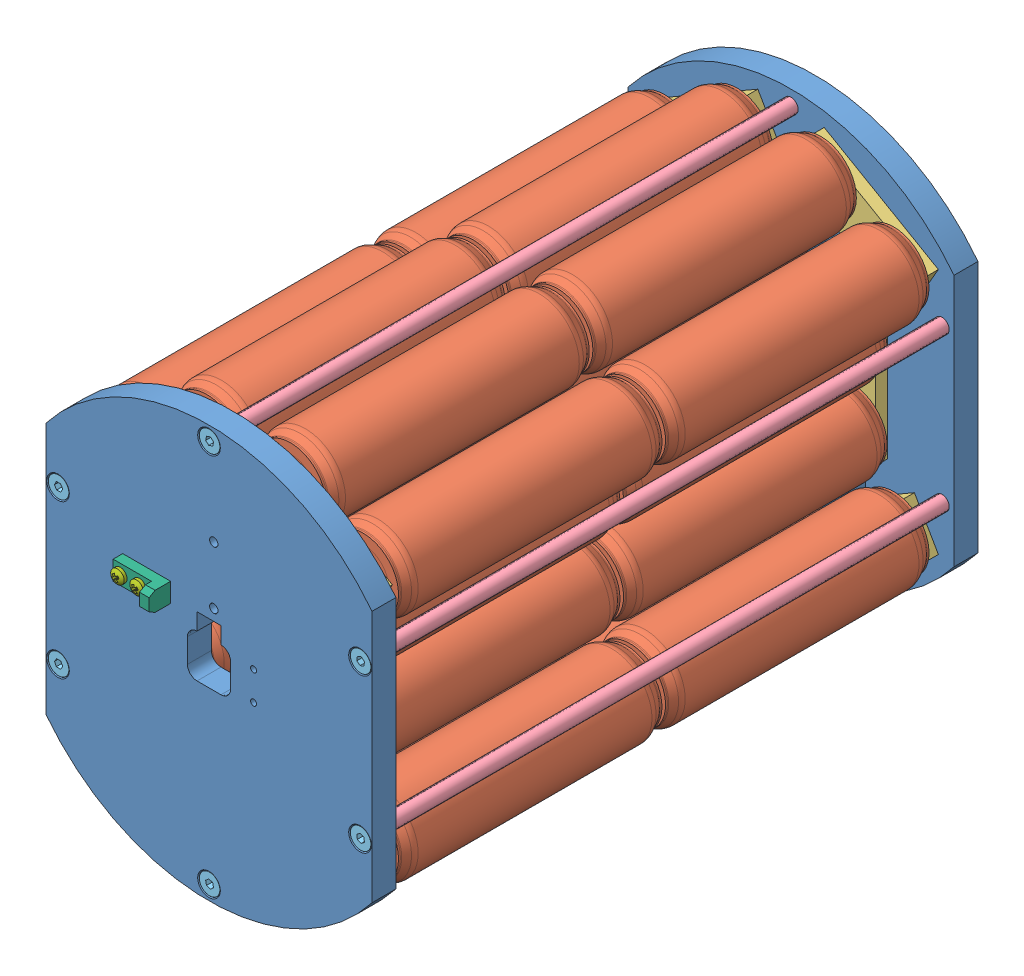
SolidWorks assembly pit_pack_complet.SLDASM, configuration Défaut (file format 4400). Lengths in mm.
Overall size (291.86 366.57 288.81).
75 component instances, 7 part files, 38 mates.
Components (placement in the parent):
- pit_pack_plaque-1: pit_pack_plaque.SLDPRT [Défaut] at origin size (136 172 20)
- pit_pack_plaque-2: pit_pack_plaque.SLDPRT [Défaut] at (0 0 -232.8) x (-1 0 0) z (0 0 -1) size (136 172 20)
- batteries_4_unites-1: batteries_4_unites.SLDASM [Défaut] at (-27.7915 41.6211 -109.8401) x (-0.314202 0.544213 0.777888) z (-0.866025 -0.5 0) size (217.02 194.11 34.92)
  - batterie_1_unite-1: batterie_1_unite.SLDPRT [Défaut] at (4.5558 16.0786 14.2424) x (0.777888 -0.628403 0) z (0.627815 0.77716 -0.043251) size (111.4 33.5 33.5)
  - batterie_1_unite-2: batterie_1_unite.SLDPRT [Défaut] at (-82.1009 86.0828 14.2424) x (0.777888 -0.628403 0) z (0.628272 0.777724 0.02048) size (111.4 33.5 33.5)
  - plaque_contact_pos-1: plaque_contact_pos.SLDPRT [Défaut] at (80.2154 -67.5386 14.2424) x (0 0 -1) z (0.777888 -0.628403 0) size (20 55 5)
  - batterie_1_unite-3: batterie_1_unite.SLDPRT [Défaut] at (-104.095 58.8567 14.2424) x (0.777888 -0.628403 0) z (0.628272 0.777724 0.02048) size (111.4 33.5 33.5)
  - batterie_1_unite-4: batterie_1_unite.SLDPRT [Défaut] at (-17.4383 -11.1475 14.2424) x (0.777888 -0.628403 0) z (0.627815 0.77716 -0.043251) size (111.4 33.5 33.5)
  - plaque_contact_pos-2: plaque_contact_pos.SLDPRT [Défaut] at (-93.0979 72.4697 14.2424) x (0 0 1) z (-0.777888 0.628403 0) size (20 55 5)
- batteries_4_unites-2: batteries_4_unites.SLDASM [Défaut] at (2.5194 59.1211 -109.8401) x (-0.314202 0.544213 0.777888) z (-0.866025 -0.5 0) size (217.02 194.11 34.92)
  - batterie_1_unite-1: batterie_1_unite.SLDPRT [Défaut] at (4.5558 16.0786 14.2424) x (0.777888 -0.628403 0) z (0.627815 0.77716 -0.043251) size (111.4 33.5 33.5)
  - batterie_1_unite-2: batterie_1_unite.SLDPRT [Défaut] at (-82.1009 86.0828 14.2424) x (0.777888 -0.628403 0) z (0.628272 0.777724 0.02048) size (111.4 33.5 33.5)
  - plaque_contact_pos-1: plaque_contact_pos.SLDPRT [Défaut] at (80.2154 -67.5386 14.2424) x (0 0 -1) z (0.777888 -0.628403 0) size (20 55 5)
  - batterie_1_unite-3: batterie_1_unite.SLDPRT [Défaut] at (-104.095 58.8567 14.2424) x (0.777888 -0.628403 0) z (0.628272 0.777724 0.02048) size (111.4 33.5 33.5)
  - batterie_1_unite-4: batterie_1_unite.SLDPRT [Défaut] at (-17.4383 -11.1475 14.2424) x (0.777888 -0.628403 0) z (0.627815 0.77716 -0.043251) size (111.4 33.5 33.5)
  - plaque_contact_pos-2: plaque_contact_pos.SLDPRT [Défaut] at (-93.0979 72.4697 14.2424) x (0 0 1) z (-0.777888 0.628403 0) size (20 55 5)
- batteries_4_unites-3: batteries_4_unites.SLDASM [Défaut] at (37.9322 69.9601 -109.8401) x (-0.544213 0.314202 0.777888) z (-0.5 -0.866025 0) size (217.02 194.11 34.92)
  - batterie_1_unite-1: batterie_1_unite.SLDPRT [Défaut] at (4.5558 16.0786 14.2424) x (0.777888 -0.628403 0) z (0.627815 0.77716 -0.043251) size (111.4 33.5 33.5)
  - batterie_1_unite-2: batterie_1_unite.SLDPRT [Défaut] at (-82.1009 86.0828 14.2424) x (0.777888 -0.628403 0) z (0.628272 0.777724 0.02048) size (111.4 33.5 33.5)
  - plaque_contact_pos-1: plaque_contact_pos.SLDPRT [Défaut] at (80.2154 -67.5386 14.2424) x (0 0 -1) z (0.777888 -0.628403 0) size (20 55 5)
  - batterie_1_unite-3: batterie_1_unite.SLDPRT [Défaut] at (-104.095 58.8567 14.2424) x (0.777888 -0.628403 0) z (0.628272 0.777724 0.02048) size (111.4 33.5 33.5)
  - batterie_1_unite-4: batterie_1_unite.SLDPRT [Défaut] at (-17.4383 -11.1475 14.2424) x (0.777888 -0.628403 0) z (0.627815 0.77716 -0.043251) size (111.4 33.5 33.5)
  - plaque_contact_pos-2: plaque_contact_pos.SLDPRT [Défaut] at (-93.0979 72.4697 14.2424) x (0 0 1) z (-0.777888 0.628403 0) size (20 55 5)
- batteries_4_unites-4: batteries_4_unites.SLDASM [Défaut] at (44.5533 2.1298 -109.8401) x (0 0.628403 0.777888) z (-1 0 0) size (217.02 194.11 34.92)
  - batterie_1_unite-1: batterie_1_unite.SLDPRT [Défaut] at (4.5558 16.0786 14.2424) x (0.777888 -0.628403 0) z (0.627815 0.77716 -0.043251) size (111.4 33.5 33.5)
  - batterie_1_unite-2: batterie_1_unite.SLDPRT [Défaut] at (-82.1009 86.0828 14.2424) x (0.777888 -0.628403 0) z (0.628272 0.777724 0.02048) size (111.4 33.5 33.5)
  - plaque_contact_pos-1: plaque_contact_pos.SLDPRT [Défaut] at (80.2154 -67.5386 14.2424) x (0 0 -1) z (0.777888 -0.628403 0) size (20 55 5)
  - batterie_1_unite-3: batterie_1_unite.SLDPRT [Défaut] at (-104.095 58.8567 14.2424) x (0.777888 -0.628403 0) z (0.628272 0.777724 0.02048) size (111.4 33.5 33.5)
  - batterie_1_unite-4: batterie_1_unite.SLDPRT [Défaut] at (-17.4383 -11.1475 14.2424) x (0.777888 -0.628403 0) z (0.627815 0.77716 -0.043251) size (111.4 33.5 33.5)
  - plaque_contact_pos-2: plaque_contact_pos.SLDPRT [Défaut] at (-93.0979 72.4697 14.2424) x (0 0 1) z (-0.777888 0.628403 0) size (20 55 5)
- batteries_4_unites-5: batteries_4_unites.SLDASM [Défaut] at (-52.4601 -27.3787 -109.8401) x (-0.314202 -0.544213 0.777888) z (0.866025 -0.5 0) size (217.02 194.11 34.92)
  - batterie_1_unite-1: batterie_1_unite.SLDPRT [Défaut] at (4.5558 16.0786 14.2424) x (0.777888 -0.628403 0) z (0.627815 0.77716 -0.043251) size (111.4 33.5 33.5)
  - batterie_1_unite-2: batterie_1_unite.SLDPRT [Défaut] at (-82.1009 86.0828 14.2424) x (0.777888 -0.628403 0) z (0.628272 0.777724 0.02048) size (111.4 33.5 33.5)
  - plaque_contact_pos-1: plaque_contact_pos.SLDPRT [Défaut] at (80.2154 -67.5386 14.2424) x (0 0 -1) z (0.777888 -0.628403 0) size (20 55 5)
  - batterie_1_unite-3: batterie_1_unite.SLDPRT [Défaut] at (-104.095 58.8567 14.2424) x (0.777888 -0.628403 0) z (0.628272 0.777724 0.02048) size (111.4 33.5 33.5)
  - batterie_1_unite-4: batterie_1_unite.SLDPRT [Défaut] at (-17.4383 -11.1475 14.2424) x (0.777888 -0.628403 0) z (0.627815 0.77716 -0.043251) size (111.4 33.5 33.5)
  - plaque_contact_pos-2: plaque_contact_pos.SLDPRT [Défaut] at (-93.0979 72.4697 14.2424) x (0 0 1) z (-0.777888 0.628403 0) size (20 55 5)
- batteries_4_unites-6: batteries_4_unites.SLDASM [Défaut] at (-22.1492 -44.8787 -109.8401) x (-0.314202 -0.544213 0.777888) z (0.866025 -0.5 0) size (217.02 194.11 34.92)
  - batterie_1_unite-1: batterie_1_unite.SLDPRT [Défaut] at (4.5558 16.0786 14.2424) x (0.777888 -0.628403 0) z (0.627815 0.77716 -0.043251) size (111.4 33.5 33.5)
  - batterie_1_unite-2: batterie_1_unite.SLDPRT [Défaut] at (-82.1009 86.0828 14.2424) x (0.777888 -0.628403 0) z (0.628272 0.777724 0.02048) size (111.4 33.5 33.5)
  - plaque_contact_pos-1: plaque_contact_pos.SLDPRT [Défaut] at (80.2154 -67.5386 14.2424) x (0 0 -1) z (0.777888 -0.628403 0) size (20 55 5)
  - batterie_1_unite-3: batterie_1_unite.SLDPRT [Défaut] at (-104.095 58.8567 14.2424) x (0.777888 -0.628403 0) z (0.628272 0.777724 0.02048) size (111.4 33.5 33.5)
  - batterie_1_unite-4: batterie_1_unite.SLDPRT [Défaut] at (-17.4383 -11.1475 14.2424) x (0.777888 -0.628403 0) z (0.627815 0.77716 -0.043251) size (111.4 33.5 33.5)
  - plaque_contact_pos-2: plaque_contact_pos.SLDPRT [Défaut] at (-93.0979 72.4697 14.2424) x (0 0 1) z (-0.777888 0.628403 0) size (20 55 5)
- batteries_4_unites-7: batteries_4_unites.SLDASM [Défaut] at (23.6898 -45.2915 -109.8401) x (-0.544213 -0.314202 0.777888) z (0.5 -0.866025 0) size (217.02 194.11 34.92)
  - batterie_1_unite-1: batterie_1_unite.SLDPRT [Défaut] at (4.5558 16.0786 14.2424) x (0.777888 -0.628403 0) z (0.627815 0.77716 -0.043251) size (111.4 33.5 33.5)
  - batterie_1_unite-2: batterie_1_unite.SLDPRT [Défaut] at (-82.1009 86.0828 14.2424) x (0.777888 -0.628403 0) z (0.628272 0.777724 0.02048) size (111.4 33.5 33.5)
  - plaque_contact_pos-1: plaque_contact_pos.SLDPRT [Défaut] at (80.2154 -67.5386 14.2424) x (0 0 -1) z (0.777888 -0.628403 0) size (20 55 5)
  - batterie_1_unite-3: batterie_1_unite.SLDPRT [Défaut] at (-104.095 58.8567 14.2424) x (0.777888 -0.628403 0) z (0.628272 0.777724 0.02048) size (111.4 33.5 33.5)
  - batterie_1_unite-4: batterie_1_unite.SLDPRT [Défaut] at (-17.4383 -11.1475 14.2424) x (0.777888 -0.628403 0) z (0.627815 0.77716 -0.043251) size (111.4 33.5 33.5)
  - plaque_contact_pos-2: plaque_contact_pos.SLDPRT [Défaut] at (-93.0979 72.4697 14.2424) x (0 0 1) z (-0.777888 0.628403 0) size (20 55 5)
- pit_pack_tube_d6-1-1: pit_pack_tube_d6-1.SLDPRT [Défaut] at (63 32 -116.4) size (6 6 232.8)
- pit_pack_tube_d6-1-2: pit_pack_tube_d6-1.SLDPRT [Défaut] at (-63 32 -116.4) size (6 6 232.8)
- pit_pack_tube_d6-1-3: pit_pack_tube_d6-1.SLDPRT [Défaut] at (0 80 -116.4) size (6 6 232.8)
- vis_fhc_m5-20-2: vis_fhc_m5-20.SLDPRT [Défaut] at (63 32 -242.55) x (0.190066 -0.981771 0) z (0.981771 0.190066 0) size (8.72 22 8.72)
- vis_fhc_m5-20-14: vis_fhc_m5-20.SLDPRT [Défaut] at (-63 32 -242.55) x (-0.345489 -0.938423 0) z (0.938423 -0.345489 0) size (8.72 22 8.72)
- vis_fhc_m5-20-16: vis_fhc_m5-20.SLDPRT [Défaut] at (0 80 -242.55) x (0.144127 -0.989559 0) z (0.989559 0.144127 0) size (8.72 22 8.72)
- vis_fhc_m5-20-18: vis_fhc_m5-20.SLDPRT [Défaut] at (0 80 9.75) x (0.205687 0.978618 0) z (0.978618 -0.205687 0) size (8.72 22 8.72)
- vis_fhc_m5-20-20: vis_fhc_m5-20.SLDPRT [Défaut] at (63 32 9.75) x (0.132637 0.991165 0) z (0.991165 -0.132637 0) size (8.72 22 8.72)
- vis_fhc_m5-20-22: vis_fhc_m5-20.SLDPRT [Défaut] at (-63 32 9.75) x (0.456777 0.889581 0) z (0.889581 -0.456777 0) size (8.72 22 8.72)
- vis_fhc_m5-20-23: vis_fhc_m5-20.SLDPRT [Défaut] at (-63 -32 9.75) x (0.456777 -0.889581 0) z (-0.889581 -0.456777 0) size (8.72 22 8.72)
- vis_fhc_m5-20-21: vis_fhc_m5-20.SLDPRT [Défaut] at (63 -32 9.75) x (0.132637 -0.991165 0) z (-0.991165 -0.132637 0) size (8.72 22 8.72)
- vis_fhc_m5-20-19: vis_fhc_m5-20.SLDPRT [Défaut] at (0 -80 9.75) x (0.205687 -0.978618 0) z (-0.978618 -0.205687 0) size (8.72 22 8.72)
- vis_fhc_m5-20-17: vis_fhc_m5-20.SLDPRT [Défaut] at (0 -80 -242.55) x (0.144127 0.989559 0) z (-0.989559 0.144127 0) size (8.72 22 8.72)
- vis_fhc_m5-20-15: vis_fhc_m5-20.SLDPRT [Défaut] at (-63 -32 -242.55) x (-0.345489 0.938423 0) z (-0.938423 -0.345489 0) size (8.72 22 8.72)
- vis_fhc_m5-20-13: vis_fhc_m5-20.SLDPRT [Défaut] at (63 -32 -242.55) x (0.190066 0.981771 0) z (-0.981771 0.190066 0) size (8.72 22 8.72)
- pit_pack_tube_d6-1-4: pit_pack_tube_d6-1.SLDPRT [Défaut] at (0 -80 -116.4) x (1 0 0) z (0 0 -1) size (6 6 232.8)
- pit_pack_tube_d6-1-5: pit_pack_tube_d6-1.SLDPRT [Défaut] at (-63 -32 -116.4) x (1 0 0) z (0 0 -1) size (6 6 232.8)
- pit_pack_tube_d6-1-6: pit_pack_tube_d6-1.SLDPRT [Défaut] at (63 -32 -116.4) x (1 0 0) z (0 0 -1) size (6 6 232.8)
- capteur_butee-1: capteur_butee.SLDPRT [Défaut] at (-16 13.5 10) x (0 0 1) z (0 1 0) size (9 20 8)
- capteur_butee-2: capteur_butee.SLDPRT [Défaut] at (16 13.5 -242.8) x (0 0 -1) z (0 1 0) size (9 20 8)
- vic_iso_7045_m3-10-z-1: vic_iso_7045_m3-10-z.SLDPRT [Défaut] at (33 17.259 -246.8) x (0 0 -1) z (0.891957 0.45212 0) size (12.41 5.6 5.6)
- vic_iso_7045_m3-10-z-2: vic_iso_7045_m3-10-z.SLDPRT [Défaut] at (-25 17.259 14) x (0 0 1) z (-0.856616 -0.515955 0) size (12.41 5.6 5.6)
- vic_iso_7045_m3-10-z-3: vic_iso_7045_m3-10-z.SLDPRT [Défaut] at (25 17.259 -246.8) x (0 0 -1) z (0.891957 0.45212 0) size (12.41 5.6 5.6)
- vic_iso_7045_m3-10-z-4: vic_iso_7045_m3-10-z.SLDPRT [Défaut] at (-33 17.259 14) x (0 0 1) z (-0.856616 -0.515955 0) size (12.41 5.6 5.6)
Mates (geometry in assembly coordinates):
- Coïncidente1: coincident aligned: plane of pit_pack_plaque-1 through (-68 52.6498 10) normal (-1 0 0); plane of pit_pack_plaque-2 through (-68 52.6498 -242.8) normal (-1 0 0)
- Parallèle1: parallel aligned: line of pit_pack_plaque-1 through (-47.8109 47.8109 0) axis (0.5 -0.866025 0); line of batteries_4_unites-1/plaque_contact_pos-1 through (-47.8109 47.8109 -5) axis (0.5 -0.866025 0)
- Coïncidente5: coincident: plane of pit_pack_plaque-1 through (0 0 0) normal (0 0 -1); line of batteries_4_unites-1/plaque_contact_pos-1 through (-61.4711 51.4711 0) axis (0.5 -0.866025 0)
- Coïncidente6: coincident: point of pit_pack_plaque-1; axis of batteries_4_unites-1/batterie_1_unite-1 through (-47.8109 47.8109 -15.668) axis (0 0 1)
- Parallèle2: parallel anti-aligned: line of pit_pack_plaque-1 through (0 35 0) axis (-0.5 0.866025 0); line of batteries_4_unites-2/plaque_contact_pos-1 through (-17.5 65.3109 -5) axis (0.5 -0.866025 0)
- Coïncidente9: coincident: point of pit_pack_plaque-1; axis of batteries_4_unites-2/batterie_1_unite-1 through (-17.5 65.3109 -15.668) axis (0 0 1)
- Coïncidente10: coincident anti-aligned: plane of pit_pack_plaque-1 through (0 0 0) normal (0 0 -1); plane of batteries_4_unites-2/plaque_contact_pos-1 through (-3.6603 21.3397 0) normal (0 0 1)
- Coïncidente11: coincident anti-aligned: plane of pit_pack_plaque-2 through (0 0 -232.8) normal (0 0 1); plane of batteries_4_unites-1/plaque_contact_pos-2 through (-16.6506 13.8397 -232.8) normal (0 0 -1)
- Coïncidente12: coincident anti-aligned: plane of pit_pack_plaque-1 through (0 0 0) normal (0 0 -1); plane of batteries_4_unites-3/plaque_contact_pos-1 through (51.4711 34.1506 0) normal (0 0 1)
- Parallèle3: parallel aligned: line of pit_pack_plaque-1 through (17.5 65.3109 0) axis (0.866025 -0.5 0); line of batteries_4_unites-3/plaque_contact_pos-1 through (17.5 65.3109 -5) axis (0.866025 -0.5 0)
- Coïncidente14: coincident: point of pit_pack_plaque-1; axis of batteries_4_unites-3/batterie_1_unite-1 through (17.5 65.3109 -15.668) axis (0 0 1)
- Coïncidente15: coincident anti-aligned: plane of pit_pack_plaque-1 through (0 0 0) normal (0 0 -1); plane of batteries_4_unites-4/plaque_contact_pos-1 through (20.3109 -27.5 0) normal (0 0 1)
- Parallèle4: parallel aligned: line of pit_pack_plaque-1 through (30.3109 17.5 0) axis (0 -1 0); line of batteries_4_unites-4/plaque_contact_pos-1 through (30.3109 17.5 -5) axis (0 -1 0)
- Coïncidente17: coincident: point of pit_pack_plaque-1; axis of batteries_4_unites-4/batterie_1_unite-1 through (30.3109 17.5 -15.668) axis (0 0 1)
- Coaxiale3: concentric anti-aligned: cylinder of pit_pack_plaque-1 through (0 0 10) axis (0 0 -1) radius 86; cylinder of pit_pack_plaque-2 through (0 0 -242.8) axis (0 0 1) radius 86
- Coïncidente28: coincident anti-aligned: plane of pit_pack_plaque-2 through (0 0 -232.8) normal (0 0 1); plane of pit_pack_tube_d6-1-1 through (63 32 -232.8) normal (0 0 -1)
- Coaxiale4: concentric aligned: cylinder of pit_pack_plaque-2 through (63 32 -232.8) axis (0 0 -1) radius 2.75; cylinder of pit_pack_tube_d6-1-1 through (63 32 0) axis (0 0 -1) radius 3
- Coïncidente29: coincident anti-aligned: plane of pit_pack_plaque-1 through (0 0 0) normal (0 0 -1); plane of pit_pack_tube_d6-1-2 through (-63 32 0) normal (0 0 1)
- Coaxiale5: concentric anti-aligned: cylinder of pit_pack_plaque-1 through (-63 32 0) axis (0 0 1) radius 2.75; cylinder of pit_pack_tube_d6-1-2 through (-63 32 0) axis (0 0 -1) radius 3
- Coïncidente30: coincident anti-aligned: plane of pit_pack_plaque-1 through (0 0 0) normal (0 0 -1); plane of pit_pack_tube_d6-1-3 through (0 80 0) normal (0 0 1)
- Coaxiale6: concentric anti-aligned: cylinder of pit_pack_plaque-1 through (0 80 0) axis (0 0 1) radius 2.75; cylinder of pit_pack_tube_d6-1-3 through (0 80 0) axis (0 0 -1) radius 3
- Coïncidente22: coincident: circle of pit_pack_plaque-2; cone of vis_fhc_m5-20-2 through (63 32 -242.55) axis (0 0 1)
- Coïncidente23: coincident: circle of pit_pack_plaque-2; cone of vis_fhc_m5-20-16 through (0 80 -242.55) axis (0 0 1)
- Coïncidente24: coincident: circle of pit_pack_plaque-2; cone of vis_fhc_m5-20-14 through (-63 32 -242.55) axis (0 0 1)
- Coïncidente25: coincident: circle of pit_pack_plaque-1; cone of vis_fhc_m5-20-22 through (-63 32 9.75) axis (0 0 -1)
- Coïncidente26: coincident: circle of pit_pack_plaque-1; cone of vis_fhc_m5-20-18 through (0 80 9.75) axis (0 0 -1)
- Coïncidente27: coincident: circle of pit_pack_plaque-1; cone of vis_fhc_m5-20-20 through (63 32 9.75) axis (0 0 -1)
- Coïncidente31: coincident anti-aligned: plane of pit_pack_plaque-1 through (0 0 10) normal (0 0 1); plane of capteur_butee-1 through (-16 21.5 10) normal (0 0 -1)
- Parallèle5: parallel aligned: plane of pit_pack_plaque-1 through (-9 -9 10) normal (0 1 0); plane of capteur_butee-1 through (-36 21.5 10) normal (0 1 0)
- Distance1: distance = 15 mm: plane of capteur_butee-1 through (-20 21.5 19) normal (-1 0 0); line of pit_pack_plaque-1 through (-5 16 10) axis (0 -1 0)
- Distance2: distance = 2.5 mm aligned: plane of pit_pack_plaque-1 through (-5 16 10) normal (0 -1 0); plane of capteur_butee-1 through (-36 13.5 10) normal (0 -1 0)
- Coïncidente35: coincident anti-aligned: plane of pit_pack_plaque-2 through (0 0 -242.8) normal (0 0 -1); plane of capteur_butee-2 through (16 21.5 -242.8) normal (0 0 1)
- Coaxiale7: concentric aligned: cylinder of pit_pack_plaque-2 through (33 17.259 -242.8) axis (0 0 -1) radius 1.25; cylinder of capteur_butee-2 through (33 17.259 -242.8) axis (0 0 -1) radius 1.75
- Coaxiale8: concentric aligned: cylinder of pit_pack_plaque-2 through (25 17.259 -242.8) axis (0 0 -1) radius 1.25; cylinder of capteur_butee-2 through (25 17.259 -242.8) axis (0 0 -1) radius 1.75
- Coïncidente36: coincident anti-aligned: plane of capteur_butee-2 through (36 21.5 -246.8) normal (0 0 -1); plane of vic_iso_7045_m3-10-z-1 through (33.6782 15.921 -246.8) normal (0 0 1)
- Coaxiale9: concentric aligned: cylinder of capteur_butee-2 through (33 17.259 -242.8) axis (0 0 -1) radius 1.75; cylinder of vic_iso_7045_m3-10-z-1 through (33 17.259 -257.8618) axis (0 0 -1) radius 1.5
- Coïncidente37: coincident anti-aligned: plane of capteur_butee-1 through (-36 21.5 14) normal (0 0 1); plane of vic_iso_7045_m3-10-z-2 through (-24.2261 15.974 14) normal (0 0 -1)
- Coaxiale10: concentric aligned: cylinder of capteur_butee-1 through (-25 17.259 10) axis (0 0 1) radius 1.75; cylinder of vic_iso_7045_m3-10-z-2 through (-25 17.259 25.0618) axis (0 0 1) radius 1.5
